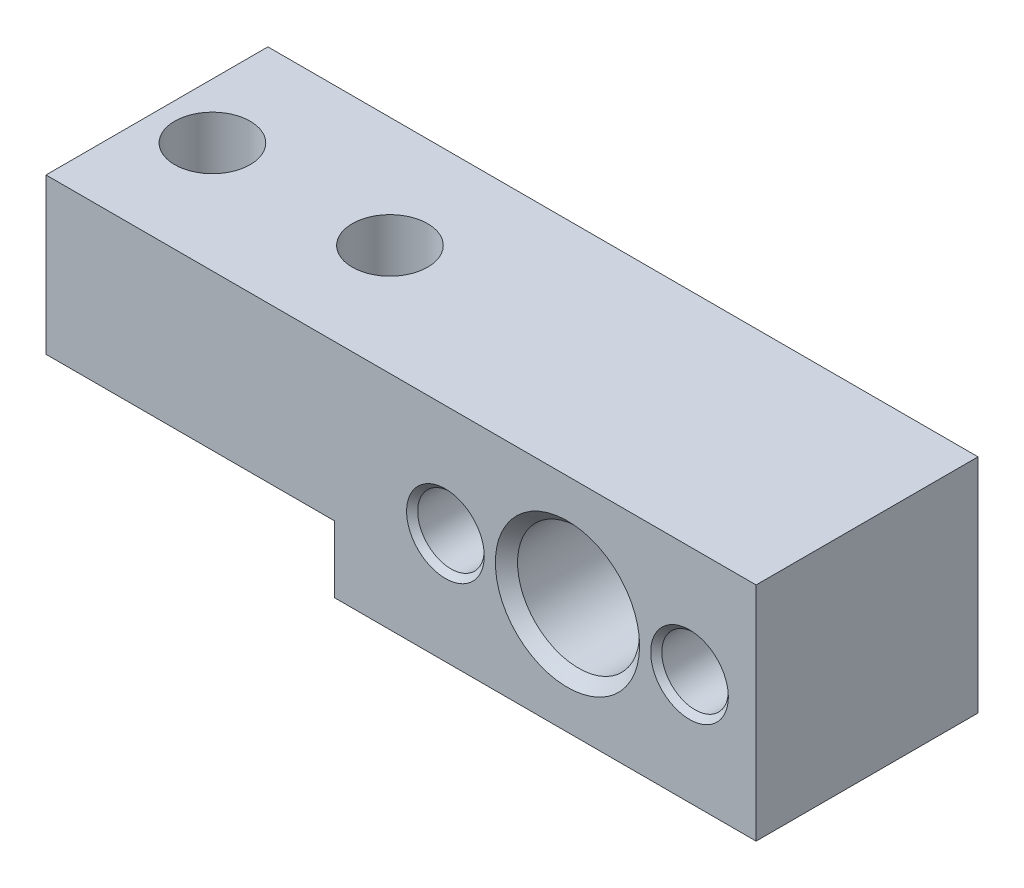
ISO-10303-21;
HEADER;
FILE_DESCRIPTION(('STEP AP214'),'2;1');
FILE_NAME('part.step','',(''),(''),'','','');
FILE_SCHEMA(('AUTOMOTIVE_DESIGN { 1 0 10303 214 1 1 1 1 }'));
ENDSEC;
DATA;
#1=APPLICATION_CONTEXT('core data for automotive mechanical design processes');
#2=APPLICATION_PROTOCOL_DEFINITION('international standard','automotive_design',2000,#1);
#3=PRODUCT_CONTEXT('',#1,'mechanical');
#4=PRODUCT('Part','Part','',(#3));
#5=PRODUCT_RELATED_PRODUCT_CATEGORY('part','',(#4));
#6=PRODUCT_DEFINITION_FORMATION('','',#4);
#7=PRODUCT_DEFINITION_CONTEXT('part definition',#1,'design');
#8=PRODUCT_DEFINITION('design','',#6,#7);
#9=PRODUCT_DEFINITION_SHAPE('','',#8);
#10=(LENGTH_UNIT() NAMED_UNIT(*) SI_UNIT(.MILLI.,.METRE.));
#11=(NAMED_UNIT(*) PLANE_ANGLE_UNIT() SI_UNIT($,.RADIAN.));
#12=(NAMED_UNIT(*) SI_UNIT($,.STERADIAN.) SOLID_ANGLE_UNIT());
#13=UNCERTAINTY_MEASURE_WITH_UNIT(LENGTH_MEASURE(1.E-05),#10,'distance_accuracy_value','');
#14=(GEOMETRIC_REPRESENTATION_CONTEXT(3) GLOBAL_UNCERTAINTY_ASSIGNED_CONTEXT((#13)) GLOBAL_UNIT_ASSIGNED_CONTEXT((#10,
#11,#12)) REPRESENTATION_CONTEXT('',''));
#15=CARTESIAN_POINT('',(0.,0.,0.));
#16=DIRECTION('',(0.,0.,1.));
#17=DIRECTION('',(1.,0.,0.));
#18=AXIS2_PLACEMENT_3D('',#15,#16,#17);
#19=CARTESIAN_POINT('',(-16.,-5.,9.99999999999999));
#20=DIRECTION('',(1.,0.,0.));
#21=DIRECTION('',(0.,0.,-1.));
#22=AXIS2_PLACEMENT_3D('',#19,#20,#21);
#23=PLANE('',#22);
#24=DIRECTION('',(0.,-1.,0.));
#25=VECTOR('',#24,1.);
#26=CARTESIAN_POINT('',(-16.,-5.,0.));
#27=LINE('',#26,#25);
#28=CARTESIAN_POINT('',(-16.,5.,0.));
#29=VERTEX_POINT('',#28);
#30=CARTESIAN_POINT('',(-16.,-2.,0.));
#31=VERTEX_POINT('',#30);
#32=EDGE_CURVE('E170',#29,#31,#27,.T.);
#33=ORIENTED_EDGE('',*,*,#32,.T.);
#34=DIRECTION('',(0.,0.,1.));
#35=VECTOR('',#34,1.);
#36=CARTESIAN_POINT('',(-16.,-2.,0.));
#37=LINE('',#36,#35);
#38=CARTESIAN_POINT('',(-16.,-2.,9.99999999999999));
#39=VERTEX_POINT('',#38);
#40=EDGE_CURVE('E167',#31,#39,#37,.T.);
#41=ORIENTED_EDGE('',*,*,#40,.T.);
#42=DIRECTION('',(0.,-1.,0.));
#43=VECTOR('',#42,1.);
#44=CARTESIAN_POINT('',(-16.,-5.,9.99999999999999));
#45=LINE('',#44,#43);
#46=CARTESIAN_POINT('',(-16.,5.,9.99999999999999));
#47=VERTEX_POINT('',#46);
#48=EDGE_CURVE('E106',#47,#39,#45,.T.);
#49=ORIENTED_EDGE('',*,*,#48,.F.);
#50=DIRECTION('',(0.,0.,-1.));
#51=VECTOR('',#50,1.);
#52=CARTESIAN_POINT('',(-16.,5.,9.99999999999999));
#53=LINE('',#52,#51);
#54=EDGE_CURVE('E114',#47,#29,#53,.T.);
#55=ORIENTED_EDGE('',*,*,#54,.T.);
#56=EDGE_LOOP('',(#33,#41,#49,#55));
#57=FACE_BOUND('',#56,.T.);
#58=ADVANCED_FACE('F28',(#57),#23,.F.);
#59=CARTESIAN_POINT('',(-16.,-5.,9.99999999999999));
#60=DIRECTION('',(0.,1.,0.));
#61=DIRECTION('',(0.,0.,1.));
#62=AXIS2_PLACEMENT_3D('',#59,#60,#61);
#63=PLANE('',#62);
#64=DIRECTION('',(1.,0.,0.));
#65=VECTOR('',#64,1.);
#66=CARTESIAN_POINT('',(-16.,-5.,9.99999999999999));
#67=LINE('',#66,#65);
#68=CARTESIAN_POINT('',(-2.99999999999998,-5.,10.));
#69=VERTEX_POINT('',#68);
#70=CARTESIAN_POINT('',(16.,-5.,10.));
#71=VERTEX_POINT('',#70);
#72=EDGE_CURVE('E96',#69,#71,#67,.T.);
#73=ORIENTED_EDGE('',*,*,#72,.F.);
#74=DIRECTION('',(0.,0.,1.));
#75=VECTOR('',#74,1.);
#76=CARTESIAN_POINT('',(-3.,-5.,0.));
#77=LINE('',#76,#75);
#78=CARTESIAN_POINT('',(-3.,-5.,0.));
#79=VERTEX_POINT('',#78);
#80=EDGE_CURVE('E83',#79,#69,#77,.T.);
#81=ORIENTED_EDGE('',*,*,#80,.F.);
#82=DIRECTION('',(1.,0.,0.));
#83=VECTOR('',#82,1.);
#84=CARTESIAN_POINT('',(-16.,-5.,0.));
#85=LINE('',#84,#83);
#86=CARTESIAN_POINT('',(16.,-5.,0.));
#87=VERTEX_POINT('',#86);
#88=EDGE_CURVE('E174',#79,#87,#85,.T.);
#89=ORIENTED_EDGE('',*,*,#88,.T.);
#90=DIRECTION('',(0.,0.,-1.));
#91=VECTOR('',#90,1.);
#92=CARTESIAN_POINT('',(16.,-5.,10.));
#93=LINE('',#92,#91);
#94=EDGE_CURVE('E103',#71,#87,#93,.T.);
#95=ORIENTED_EDGE('',*,*,#94,.F.);
#96=EDGE_LOOP('',(#73,#81,#89,#95));
#97=FACE_BOUND('',#96,.T.);
#98=ADVANCED_FACE('F101',(#97),#63,.F.);
#99=CARTESIAN_POINT('',(16.,-5.,10.));
#100=DIRECTION('',(-1.,0.,0.));
#101=DIRECTION('',(0.,0.,1.));
#102=AXIS2_PLACEMENT_3D('',#99,#100,#101);
#103=PLANE('',#102);
#104=DIRECTION('',(0.,1.,0.));
#105=VECTOR('',#104,1.);
#106=CARTESIAN_POINT('',(16.,-5.,0.));
#107=LINE('',#106,#105);
#108=CARTESIAN_POINT('',(16.,5.,0.));
#109=VERTEX_POINT('',#108);
#110=EDGE_CURVE('E176',#87,#109,#107,.T.);
#111=ORIENTED_EDGE('',*,*,#110,.T.);
#112=DIRECTION('',(0.,0.,-1.));
#113=VECTOR('',#112,1.);
#114=CARTESIAN_POINT('',(16.,5.,10.));
#115=LINE('',#114,#113);
#116=CARTESIAN_POINT('',(16.,5.,10.));
#117=VERTEX_POINT('',#116);
#118=EDGE_CURVE('E117',#117,#109,#115,.T.);
#119=ORIENTED_EDGE('',*,*,#118,.F.);
#120=DIRECTION('',(0.,1.,0.));
#121=VECTOR('',#120,1.);
#122=CARTESIAN_POINT('',(16.,-5.,10.));
#123=LINE('',#122,#121);
#124=EDGE_CURVE('E105',#71,#117,#123,.T.);
#125=ORIENTED_EDGE('',*,*,#124,.F.);
#126=ORIENTED_EDGE('',*,*,#94,.T.);
#127=EDGE_LOOP('',(#111,#119,#125,#126));
#128=FACE_BOUND('',#127,.T.);
#129=ADVANCED_FACE('F188',(#128),#103,.F.);
#130=CARTESIAN_POINT('',(-16.,5.,9.99999999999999));
#131=DIRECTION('',(0.,-1.,0.));
#132=DIRECTION('',(0.,0.,-1.));
#133=AXIS2_PLACEMENT_3D('',#130,#131,#132);
#134=PLANE('',#133);
#135=CARTESIAN_POINT('',(-13.5,5.,5.));
#136=DIRECTION('',(0.,1.,0.));
#137=DIRECTION('',(0.,0.,1.));
#138=AXIS2_PLACEMENT_3D('',#135,#136,#137);
#139=CIRCLE('',#138,1.69999999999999);
#140=CARTESIAN_POINT('',(-13.5,5.,6.7));
#141=VERTEX_POINT('',#140);
#142=EDGE_CURVE('E161',#141,#141,#139,.T.);
#143=ORIENTED_EDGE('',*,*,#142,.F.);
#144=EDGE_LOOP('',(#143));
#145=FACE_BOUND('',#144,.T.);
#146=CARTESIAN_POINT('',(-5.50000000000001,5.,5.));
#147=DIRECTION('',(0.,1.,0.));
#148=DIRECTION('',(0.,0.,1.));
#149=AXIS2_PLACEMENT_3D('',#146,#147,#148);
#150=CIRCLE('',#149,1.69999999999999);
#151=CARTESIAN_POINT('',(-5.50000000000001,5.,6.7));
#152=VERTEX_POINT('',#151);
#153=EDGE_CURVE('E153',#152,#152,#150,.T.);
#154=ORIENTED_EDGE('',*,*,#153,.F.);
#155=EDGE_LOOP('',(#154));
#156=FACE_BOUND('',#155,.T.);
#157=DIRECTION('',(-1.,0.,0.));
#158=VECTOR('',#157,1.);
#159=CARTESIAN_POINT('',(-16.,5.,0.));
#160=LINE('',#159,#158);
#161=EDGE_CURVE('E109',#109,#29,#160,.T.);
#162=ORIENTED_EDGE('',*,*,#161,.T.);
#163=ORIENTED_EDGE('',*,*,#54,.F.);
#164=DIRECTION('',(-1.,0.,0.));
#165=VECTOR('',#164,1.);
#166=CARTESIAN_POINT('',(-16.,5.,9.99999999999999));
#167=LINE('',#166,#165);
#168=EDGE_CURVE('E52',#117,#47,#167,.T.);
#169=ORIENTED_EDGE('',*,*,#168,.F.);
#170=ORIENTED_EDGE('',*,*,#118,.T.);
#171=EDGE_LOOP('',(#162,#163,#169,#170));
#172=FACE_BOUND('',#171,.T.);
#173=ADVANCED_FACE('F179',(#145,#156,#172),#134,.F.);
#174=CARTESIAN_POINT('',(-16.,5.,9.99999999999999));
#175=DIRECTION('',(0.,0.,-1.));
#176=DIRECTION('',(-1.,0.,0.));
#177=AXIS2_PLACEMENT_3D('',#174,#175,#176);
#178=PLANE('',#177);
#179=CARTESIAN_POINT('',(13.,0.,9.99999999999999));
#180=DIRECTION('',(0.,0.,-1.));
#181=DIRECTION('',(-1.,0.,0.));
#182=AXIS2_PLACEMENT_3D('',#179,#180,#181);
#183=CIRCLE('',#182,1.75);
#184=CARTESIAN_POINT('',(14.75,0.,10.));
#185=VERTEX_POINT('',#184);
#186=EDGE_CURVE('E148',#185,#185,#183,.T.);
#187=ORIENTED_EDGE('',*,*,#186,.T.);
#188=EDGE_LOOP('',(#187));
#189=FACE_BOUND('',#188,.T.);
#190=CARTESIAN_POINT('',(1.99999999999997,0.,9.99999999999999));
#191=DIRECTION('',(0.,0.,-1.));
#192=DIRECTION('',(-1.,0.,0.));
#193=AXIS2_PLACEMENT_3D('',#190,#191,#192);
#194=CIRCLE('',#193,1.75);
#195=CARTESIAN_POINT('',(3.74999999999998,0.,10.));
#196=VERTEX_POINT('',#195);
#197=EDGE_CURVE('E145',#196,#196,#194,.T.);
#198=ORIENTED_EDGE('',*,*,#197,.T.);
#199=EDGE_LOOP('',(#198));
#200=FACE_BOUND('',#199,.T.);
#201=CARTESIAN_POINT('',(7.49999999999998,0.,9.99999999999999));
#202=DIRECTION('',(0.,0.,-1.));
#203=DIRECTION('',(-1.,0.,0.));
#204=AXIS2_PLACEMENT_3D('',#201,#202,#203);
#205=CIRCLE('',#204,3.25);
#206=CARTESIAN_POINT('',(10.75,0.,10.));
#207=VERTEX_POINT('',#206);
#208=EDGE_CURVE('E130',#207,#207,#205,.T.);
#209=ORIENTED_EDGE('',*,*,#208,.T.);
#210=EDGE_LOOP('',(#209));
#211=FACE_BOUND('',#210,.T.);
#212=ORIENTED_EDGE('',*,*,#48,.T.);
#213=DIRECTION('',(-1.,0.,0.));
#214=VECTOR('',#213,1.);
#215=CARTESIAN_POINT('',(-16.,-2.,9.99999999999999));
#216=LINE('',#215,#214);
#217=CARTESIAN_POINT('',(-3.,-2.00000000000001,10.));
#218=VERTEX_POINT('',#217);
#219=EDGE_CURVE('E98',#218,#39,#216,.T.);
#220=ORIENTED_EDGE('',*,*,#219,.F.);
#221=DIRECTION('',(0.,1.,0.));
#222=VECTOR('',#221,1.);
#223=CARTESIAN_POINT('',(-2.99999999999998,-5.,10.));
#224=LINE('',#223,#222);
#225=EDGE_CURVE('E86',#69,#218,#224,.T.);
#226=ORIENTED_EDGE('',*,*,#225,.F.);
#227=ORIENTED_EDGE('',*,*,#72,.T.);
#228=ORIENTED_EDGE('',*,*,#124,.T.);
#229=ORIENTED_EDGE('',*,*,#168,.T.);
#230=EDGE_LOOP('',(#212,#220,#226,#227,#228,#229));
#231=FACE_BOUND('',#230,.T.);
#232=ADVANCED_FACE('F95',(#189,#200,#211,#231),#178,.F.);
#233=CARTESIAN_POINT('',(-16.,5.,0.));
#234=DIRECTION('',(0.,0.,-1.));
#235=DIRECTION('',(-1.,0.,0.));
#236=AXIS2_PLACEMENT_3D('',#233,#234,#235);
#237=PLANE('',#236);
#238=CARTESIAN_POINT('',(13.,0.,0.));
#239=DIRECTION('',(0.,0.,-1.));
#240=DIRECTION('',(-1.,0.,0.));
#241=AXIS2_PLACEMENT_3D('',#238,#239,#240);
#242=CIRCLE('',#241,1.75);
#243=CARTESIAN_POINT('',(11.25,0.,0.));
#244=VERTEX_POINT('',#243);
#245=EDGE_CURVE('E136',#244,#244,#242,.F.);
#246=ORIENTED_EDGE('',*,*,#245,.T.);
#247=EDGE_LOOP('',(#246));
#248=FACE_BOUND('',#247,.T.);
#249=CARTESIAN_POINT('',(1.99999999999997,0.,0.));
#250=DIRECTION('',(0.,0.,-1.));
#251=DIRECTION('',(-1.,0.,0.));
#252=AXIS2_PLACEMENT_3D('',#249,#250,#251);
#253=CIRCLE('',#252,1.75);
#254=CARTESIAN_POINT('',(0.249999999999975,0.,0.));
#255=VERTEX_POINT('',#254);
#256=EDGE_CURVE('E133',#255,#255,#253,.F.);
#257=ORIENTED_EDGE('',*,*,#256,.T.);
#258=EDGE_LOOP('',(#257));
#259=FACE_BOUND('',#258,.T.);
#260=CARTESIAN_POINT('',(7.49999999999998,0.,0.));
#261=DIRECTION('',(0.,0.,-1.));
#262=DIRECTION('',(-1.,0.,0.));
#263=AXIS2_PLACEMENT_3D('',#260,#261,#262);
#264=CIRCLE('',#263,3.25);
#265=CARTESIAN_POINT('',(4.24999999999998,0.,0.));
#266=VERTEX_POINT('',#265);
#267=EDGE_CURVE('E121',#266,#266,#264,.F.);
#268=ORIENTED_EDGE('',*,*,#267,.T.);
#269=EDGE_LOOP('',(#268));
#270=FACE_BOUND('',#269,.T.);
#271=DIRECTION('',(-1.,0.,0.));
#272=VECTOR('',#271,1.);
#273=CARTESIAN_POINT('',(-16.,-2.,0.));
#274=LINE('',#273,#272);
#275=CARTESIAN_POINT('',(-3.,-2.,0.));
#276=VERTEX_POINT('',#275);
#277=EDGE_CURVE('E44',#276,#31,#274,.T.);
#278=ORIENTED_EDGE('',*,*,#277,.T.);
#279=ORIENTED_EDGE('',*,*,#32,.F.);
#280=ORIENTED_EDGE('',*,*,#161,.F.);
#281=ORIENTED_EDGE('',*,*,#110,.F.);
#282=ORIENTED_EDGE('',*,*,#88,.F.);
#283=DIRECTION('',(0.,1.,0.));
#284=VECTOR('',#283,1.);
#285=CARTESIAN_POINT('',(-3.,-5.,0.));
#286=LINE('',#285,#284);
#287=EDGE_CURVE('E89',#79,#276,#286,.T.);
#288=ORIENTED_EDGE('',*,*,#287,.T.);
#289=EDGE_LOOP('',(#278,#279,#280,#281,#282,#288));
#290=FACE_BOUND('',#289,.T.);
#291=ADVANCED_FACE('F186',(#248,#259,#270,#290),#237,.T.);
#292=CARTESIAN_POINT('',(-16.,-2.,0.));
#293=DIRECTION('',(0.,1.,0.));
#294=DIRECTION('',(0.,0.,1.));
#295=AXIS2_PLACEMENT_3D('',#292,#293,#294);
#296=PLANE('',#295);
#297=CARTESIAN_POINT('',(-13.5,-2.,5.));
#298=DIRECTION('',(0.,1.,0.));
#299=DIRECTION('',(0.,0.,1.));
#300=AXIS2_PLACEMENT_3D('',#297,#298,#299);
#301=CIRCLE('',#300,1.69999999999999);
#302=CARTESIAN_POINT('',(-13.5,-2.,6.7));
#303=VERTEX_POINT('',#302);
#304=EDGE_CURVE('E31',#303,#303,#301,.T.);
#305=ORIENTED_EDGE('',*,*,#304,.T.);
#306=EDGE_LOOP('',(#305));
#307=FACE_BOUND('',#306,.T.);
#308=CARTESIAN_POINT('',(-5.49999999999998,-2.,5.));
#309=DIRECTION('',(0.,1.,0.));
#310=DIRECTION('',(0.,0.,1.));
#311=AXIS2_PLACEMENT_3D('',#308,#309,#310);
#312=CIRCLE('',#311,1.69999999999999);
#313=CARTESIAN_POINT('',(-5.50000000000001,-2.,6.7));
#314=VERTEX_POINT('',#313);
#315=EDGE_CURVE('E99',#314,#314,#312,.T.);
#316=ORIENTED_EDGE('',*,*,#315,.T.);
#317=EDGE_LOOP('',(#316));
#318=FACE_BOUND('',#317,.T.);
#319=ORIENTED_EDGE('',*,*,#219,.T.);
#320=ORIENTED_EDGE('',*,*,#40,.F.);
#321=ORIENTED_EDGE('',*,*,#277,.F.);
#322=DIRECTION('',(0.,0.,1.));
#323=VECTOR('',#322,1.);
#324=CARTESIAN_POINT('',(-3.,-2.,0.));
#325=LINE('',#324,#323);
#326=EDGE_CURVE('E93',#276,#218,#325,.T.);
#327=ORIENTED_EDGE('',*,*,#326,.T.);
#328=EDGE_LOOP('',(#319,#320,#321,#327));
#329=FACE_BOUND('',#328,.T.);
#330=ADVANCED_FACE('F232',(#307,#318,#329),#296,.F.);
#331=CARTESIAN_POINT('',(-3.,-5.,0.));
#332=DIRECTION('',(1.,0.,0.));
#333=DIRECTION('',(0.,0.,-1.));
#334=AXIS2_PLACEMENT_3D('',#331,#332,#333);
#335=PLANE('',#334);
#336=ORIENTED_EDGE('',*,*,#225,.T.);
#337=ORIENTED_EDGE('',*,*,#326,.F.);
#338=ORIENTED_EDGE('',*,*,#287,.F.);
#339=ORIENTED_EDGE('',*,*,#80,.T.);
#340=EDGE_LOOP('',(#336,#337,#338,#339));
#341=FACE_BOUND('',#340,.T.);
#342=ADVANCED_FACE('F85',(#341),#335,.F.);
#343=CARTESIAN_POINT('',(7.49999999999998,0.,0.));
#344=DIRECTION('',(0.,0.,1.));
#345=DIRECTION('',(1.,0.,0.));
#346=AXIS2_PLACEMENT_3D('',#343,#344,#345);
#347=CYLINDRICAL_SURFACE('',#346,2.75);
#348=CARTESIAN_POINT('',(7.49999999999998,0.,0.500000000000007));
#349=DIRECTION('',(0.,0.,-1.));
#350=DIRECTION('',(-1.,0.,0.));
#351=AXIS2_PLACEMENT_3D('',#348,#349,#350);
#352=CIRCLE('',#351,2.75);
#353=CARTESIAN_POINT('',(10.25,0.,0.500000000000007));
#354=VERTEX_POINT('',#353);
#355=EDGE_CURVE('E127',#354,#354,#352,.T.);
#356=CARTESIAN_POINT('',(7.49999999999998,0.,9.49999999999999));
#357=DIRECTION('',(0.,0.,-1.));
#358=DIRECTION('',(-1.,0.,0.));
#359=AXIS2_PLACEMENT_3D('',#356,#357,#358);
#360=CIRCLE('',#359,2.75);
#361=CARTESIAN_POINT('',(10.25,0.,9.5));
#362=VERTEX_POINT('',#361);
#363=EDGE_CURVE('E124',#362,#362,#360,.F.);
#364=CARTESIAN_POINT('',(10.25,0.,0.500000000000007));
#365=CARTESIAN_POINT('',(10.25,0.,0.593750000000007));
#366=CARTESIAN_POINT('',(10.25,0.,0.687500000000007));
#367=CARTESIAN_POINT('',(10.25,0.,0.875000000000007));
#368=CARTESIAN_POINT('',(10.25,0.,0.968750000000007));
#369=CARTESIAN_POINT('',(10.25,0.,1.15625000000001));
#370=CARTESIAN_POINT('',(10.25,0.,1.25000000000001));
#371=CARTESIAN_POINT('',(10.25,0.,1.43750000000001));
#372=CARTESIAN_POINT('',(10.25,0.,1.53125000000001));
#373=CARTESIAN_POINT('',(10.25,0.,1.71875000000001));
#374=CARTESIAN_POINT('',(10.25,0.,1.81250000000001));
#375=CARTESIAN_POINT('',(10.25,0.,2.00000000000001));
#376=CARTESIAN_POINT('',(10.25,0.,2.09375000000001));
#377=CARTESIAN_POINT('',(10.25,0.,2.28125000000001));
#378=CARTESIAN_POINT('',(10.25,0.,2.37500000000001));
#379=CARTESIAN_POINT('',(10.25,0.,2.5625));
#380=CARTESIAN_POINT('',(10.25,0.,2.65625));
#381=CARTESIAN_POINT('',(10.25,0.,2.84375));
#382=CARTESIAN_POINT('',(10.25,0.,2.9375));
#383=CARTESIAN_POINT('',(10.25,0.,3.125));
#384=CARTESIAN_POINT('',(10.25,0.,3.21875));
#385=CARTESIAN_POINT('',(10.25,0.,3.40625));
#386=CARTESIAN_POINT('',(10.25,0.,3.5));
#387=CARTESIAN_POINT('',(10.25,0.,3.6875));
#388=CARTESIAN_POINT('',(10.25,0.,3.78125));
#389=CARTESIAN_POINT('',(10.25,0.,3.96875));
#390=CARTESIAN_POINT('',(10.25,0.,4.0625));
#391=CARTESIAN_POINT('',(10.25,0.,4.25));
#392=CARTESIAN_POINT('',(10.25,0.,4.34375));
#393=CARTESIAN_POINT('',(10.25,0.,4.53125));
#394=CARTESIAN_POINT('',(10.25,0.,4.625));
#395=CARTESIAN_POINT('',(10.25,0.,4.8125));
#396=CARTESIAN_POINT('',(10.25,0.,4.90625));
#397=CARTESIAN_POINT('',(10.25,0.,5.09375));
#398=CARTESIAN_POINT('',(10.25,0.,5.1875));
#399=CARTESIAN_POINT('',(10.25,0.,5.375));
#400=CARTESIAN_POINT('',(10.25,0.,5.46875));
#401=CARTESIAN_POINT('',(10.25,0.,5.65625));
#402=CARTESIAN_POINT('',(10.25,0.,5.75));
#403=CARTESIAN_POINT('',(10.25,0.,5.9375));
#404=CARTESIAN_POINT('',(10.25,0.,6.03125));
#405=CARTESIAN_POINT('',(10.25,0.,6.21875));
#406=CARTESIAN_POINT('',(10.25,0.,6.3125));
#407=CARTESIAN_POINT('',(10.25,0.,6.5));
#408=CARTESIAN_POINT('',(10.25,0.,6.59375));
#409=CARTESIAN_POINT('',(10.25,0.,6.78125));
#410=CARTESIAN_POINT('',(10.25,0.,6.875));
#411=CARTESIAN_POINT('',(10.25,0.,7.0625));
#412=CARTESIAN_POINT('',(10.25,0.,7.15625));
#413=CARTESIAN_POINT('',(10.25,0.,7.34375));
#414=CARTESIAN_POINT('',(10.25,0.,7.4375));
#415=CARTESIAN_POINT('',(10.25,0.,7.625));
#416=CARTESIAN_POINT('',(10.25,0.,7.71875));
#417=CARTESIAN_POINT('',(10.25,0.,7.90625));
#418=CARTESIAN_POINT('',(10.25,0.,8.));
#419=CARTESIAN_POINT('',(10.25,0.,8.1875));
#420=CARTESIAN_POINT('',(10.25,0.,8.28125));
#421=CARTESIAN_POINT('',(10.25,0.,8.46875));
#422=CARTESIAN_POINT('',(10.25,0.,8.5625));
#423=CARTESIAN_POINT('',(10.25,0.,8.75));
#424=CARTESIAN_POINT('',(10.25,0.,8.84375));
#425=CARTESIAN_POINT('',(10.25,0.,9.03125));
#426=CARTESIAN_POINT('',(10.25,0.,9.125));
#427=CARTESIAN_POINT('',(10.25,0.,9.3125));
#428=CARTESIAN_POINT('',(10.25,0.,9.40625));
#429=CARTESIAN_POINT('',(10.25,0.,9.5));
#430=B_SPLINE_CURVE_WITH_KNOTS('',3,(#364,#365,#366,#367,#368,#369,#370,#371,#372,#373,#374,
#375,#376,#377,#378,#379,#380,#381,#382,#383,#384,#385,#386,#387,#388,#389,#390,#391,#392,#393,
#394,#395,#396,#397,#398,#399,#400,#401,#402,#403,#404,#405,#406,#407,#408,#409,#410,#411,#412,
#413,#414,#415,#416,#417,#418,#419,#420,#421,#422,#423,#424,#425,#426,#427,#428,#429),
.UNSPECIFIED.,.F.,.F.,(4,2,2,2,2,2,2,2,2,2,2,2,2,2,2,2,2,2,2,2,2,2,2,2,2,2,2,2,2,2,2,2,4),(0.,
0.28125,0.562499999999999,0.843749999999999,1.125,1.40625,1.6875,1.96875,2.25,2.53125,2.8125,
3.09375,3.375,3.65625,3.93749999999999,4.21874999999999,4.49999999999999,4.78124999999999,
5.06249999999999,5.34374999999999,5.62499999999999,5.90624999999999,6.18749999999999,
6.46874999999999,6.74999999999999,7.03124999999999,7.31249999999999,7.59374999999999,
7.87499999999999,8.15624999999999,8.43749999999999,8.71874999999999,8.99999999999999),.UNSPECIFIED.);
#431=EDGE_CURVE('BSEAM251',#354,#362,#430,.T.);
#432=ORIENTED_EDGE('',*,*,#355,.T.);
#433=ORIENTED_EDGE('',*,*,#363,.T.);
#434=ORIENTED_EDGE('',*,*,#431,.T.);
#435=ORIENTED_EDGE('',*,*,#431,.F.);
#436=EDGE_LOOP('',(#432,#434,#433,#435));
#437=FACE_BOUND('',#436,.T.);
#438=ADVANCED_FACE('F251',(#437),#347,.F.);
#439=CARTESIAN_POINT('',(13.,0.,0.));
#440=DIRECTION('',(0.,0.,1.));
#441=DIRECTION('',(1.,0.,0.));
#442=AXIS2_PLACEMENT_3D('',#439,#440,#441);
#443=CYLINDRICAL_SURFACE('',#442,1.5);
#444=CARTESIAN_POINT('',(13.,0.,0.250000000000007));
#445=DIRECTION('',(0.,0.,-1.));
#446=DIRECTION('',(-1.,0.,0.));
#447=AXIS2_PLACEMENT_3D('',#444,#445,#446);
#448=CIRCLE('',#447,1.5);
#449=CARTESIAN_POINT('',(14.5,0.,0.250000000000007));
#450=VERTEX_POINT('',#449);
#451=EDGE_CURVE('E142',#450,#450,#448,.T.);
#452=CARTESIAN_POINT('',(13.,0.,9.74999999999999));
#453=DIRECTION('',(0.,0.,-1.));
#454=DIRECTION('',(-1.,0.,0.));
#455=AXIS2_PLACEMENT_3D('',#452,#453,#454);
#456=CIRCLE('',#455,1.5);
#457=CARTESIAN_POINT('',(14.5,0.,9.75));
#458=VERTEX_POINT('',#457);
#459=EDGE_CURVE('E139',#458,#458,#456,.F.);
#460=CARTESIAN_POINT('',(14.5,0.,0.250000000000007));
#461=CARTESIAN_POINT('',(14.5,0.,0.34895833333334));
#462=CARTESIAN_POINT('',(14.5,0.,0.447916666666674));
#463=CARTESIAN_POINT('',(14.5,0.,0.64583333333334));
#464=CARTESIAN_POINT('',(14.5,0.,0.744791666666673));
#465=CARTESIAN_POINT('',(14.5,0.,0.94270833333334));
#466=CARTESIAN_POINT('',(14.5,0.,1.04166666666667));
#467=CARTESIAN_POINT('',(14.5,0.,1.23958333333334));
#468=CARTESIAN_POINT('',(14.5,0.,1.33854166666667));
#469=CARTESIAN_POINT('',(14.5,0.,1.53645833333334));
#470=CARTESIAN_POINT('',(14.5,0.,1.63541666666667));
#471=CARTESIAN_POINT('',(14.5,0.,1.83333333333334));
#472=CARTESIAN_POINT('',(14.5,0.,1.93229166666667));
#473=CARTESIAN_POINT('',(14.5,0.,2.13020833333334));
#474=CARTESIAN_POINT('',(14.5,0.,2.22916666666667));
#475=CARTESIAN_POINT('',(14.5,0.,2.42708333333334));
#476=CARTESIAN_POINT('',(14.5,0.,2.52604166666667));
#477=CARTESIAN_POINT('',(14.5,0.,2.72395833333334));
#478=CARTESIAN_POINT('',(14.5,0.,2.82291666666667));
#479=CARTESIAN_POINT('',(14.5,0.,3.02083333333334));
#480=CARTESIAN_POINT('',(14.5,0.,3.11979166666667));
#481=CARTESIAN_POINT('',(14.5,0.,3.31770833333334));
#482=CARTESIAN_POINT('',(14.5,0.,3.41666666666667));
#483=CARTESIAN_POINT('',(14.5,0.,3.61458333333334));
#484=CARTESIAN_POINT('',(14.5,0.,3.71354166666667));
#485=CARTESIAN_POINT('',(14.5,0.,3.91145833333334));
#486=CARTESIAN_POINT('',(14.5,0.,4.01041666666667));
#487=CARTESIAN_POINT('',(14.5,0.,4.20833333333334));
#488=CARTESIAN_POINT('',(14.5,0.,4.30729166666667));
#489=CARTESIAN_POINT('',(14.5,0.,4.50520833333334));
#490=CARTESIAN_POINT('',(14.5,0.,4.60416666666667));
#491=CARTESIAN_POINT('',(14.5,0.,4.80208333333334));
#492=CARTESIAN_POINT('',(14.5,0.,4.90104166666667));
#493=CARTESIAN_POINT('',(14.5,0.,5.09895833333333));
#494=CARTESIAN_POINT('',(14.5,0.,5.19791666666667));
#495=CARTESIAN_POINT('',(14.5,0.,5.39583333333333));
#496=CARTESIAN_POINT('',(14.5,0.,5.49479166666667));
#497=CARTESIAN_POINT('',(14.5,0.,5.69270833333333));
#498=CARTESIAN_POINT('',(14.5,0.,5.79166666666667));
#499=CARTESIAN_POINT('',(14.5,0.,5.98958333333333));
#500=CARTESIAN_POINT('',(14.5,0.,6.08854166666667));
#501=CARTESIAN_POINT('',(14.5,0.,6.28645833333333));
#502=CARTESIAN_POINT('',(14.5,0.,6.38541666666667));
#503=CARTESIAN_POINT('',(14.5,0.,6.58333333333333));
#504=CARTESIAN_POINT('',(14.5,0.,6.68229166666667));
#505=CARTESIAN_POINT('',(14.5,0.,6.88020833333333));
#506=CARTESIAN_POINT('',(14.5,0.,6.97916666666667));
#507=CARTESIAN_POINT('',(14.5,0.,7.17708333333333));
#508=CARTESIAN_POINT('',(14.5,0.,7.27604166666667));
#509=CARTESIAN_POINT('',(14.5,0.,7.47395833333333));
#510=CARTESIAN_POINT('',(14.5,0.,7.57291666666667));
#511=CARTESIAN_POINT('',(14.5,0.,7.77083333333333));
#512=CARTESIAN_POINT('',(14.5,0.,7.86979166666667));
#513=CARTESIAN_POINT('',(14.5,0.,8.06770833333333));
#514=CARTESIAN_POINT('',(14.5,0.,8.16666666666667));
#515=CARTESIAN_POINT('',(14.5,0.,8.36458333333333));
#516=CARTESIAN_POINT('',(14.5,0.,8.46354166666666));
#517=CARTESIAN_POINT('',(14.5,0.,8.66145833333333));
#518=CARTESIAN_POINT('',(14.5,0.,8.76041666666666));
#519=CARTESIAN_POINT('',(14.5,0.,8.95833333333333));
#520=CARTESIAN_POINT('',(14.5,0.,9.05729166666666));
#521=CARTESIAN_POINT('',(14.5,0.,9.25520833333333));
#522=CARTESIAN_POINT('',(14.5,0.,9.35416666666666));
#523=CARTESIAN_POINT('',(14.5,0.,9.55208333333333));
#524=CARTESIAN_POINT('',(14.5,0.,9.65104166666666));
#525=CARTESIAN_POINT('',(14.5,0.,9.75));
#526=B_SPLINE_CURVE_WITH_KNOTS('',3,(#460,#461,#462,#463,#464,#465,#466,#467,#468,#469,#470,
#471,#472,#473,#474,#475,#476,#477,#478,#479,#480,#481,#482,#483,#484,#485,#486,#487,#488,#489,
#490,#491,#492,#493,#494,#495,#496,#497,#498,#499,#500,#501,#502,#503,#504,#505,#506,#507,#508,
#509,#510,#511,#512,#513,#514,#515,#516,#517,#518,#519,#520,#521,#522,#523,#524,#525),
.UNSPECIFIED.,.F.,.F.,(4,2,2,2,2,2,2,2,2,2,2,2,2,2,2,2,2,2,2,2,2,2,2,2,2,2,2,2,2,2,2,2,4),(0.,
0.296875,0.593749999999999,0.890624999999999,1.1875,1.484375,1.78125,2.078125,2.375,2.671875,
2.96875,3.265625,3.5625,3.859375,4.15624999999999,4.453125,4.74999999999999,5.04687499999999,
5.34374999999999,5.64062499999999,5.93749999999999,6.23437499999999,6.53124999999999,
6.82812499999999,7.12499999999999,7.42187499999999,7.71874999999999,8.01562499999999,
8.31249999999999,8.60937499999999,8.90624999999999,9.20312499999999,9.49999999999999),.UNSPECIFIED.);
#527=EDGE_CURVE('BSEAM260',#450,#458,#526,.T.);
#528=ORIENTED_EDGE('',*,*,#451,.T.);
#529=ORIENTED_EDGE('',*,*,#459,.T.);
#530=ORIENTED_EDGE('',*,*,#527,.T.);
#531=ORIENTED_EDGE('',*,*,#527,.F.);
#532=EDGE_LOOP('',(#528,#530,#529,#531));
#533=FACE_BOUND('',#532,.T.);
#534=ADVANCED_FACE('F260',(#533),#443,.F.);
#535=CARTESIAN_POINT('',(1.99999999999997,0.,0.));
#536=DIRECTION('',(0.,0.,1.));
#537=DIRECTION('',(1.,0.,0.));
#538=AXIS2_PLACEMENT_3D('',#535,#536,#537);
#539=CYLINDRICAL_SURFACE('',#538,1.5);
#540=CARTESIAN_POINT('',(1.99999999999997,0.,0.250000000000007));
#541=DIRECTION('',(0.,0.,-1.));
#542=DIRECTION('',(-1.,0.,0.));
#543=AXIS2_PLACEMENT_3D('',#540,#541,#542);
#544=CIRCLE('',#543,1.5);
#545=CARTESIAN_POINT('',(3.49999999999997,0.,0.250000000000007));
#546=VERTEX_POINT('',#545);
#547=EDGE_CURVE('E11',#546,#546,#544,.T.);
#548=CARTESIAN_POINT('',(1.99999999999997,0.,9.74999999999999));
#549=DIRECTION('',(0.,0.,-1.));
#550=DIRECTION('',(-1.,0.,0.));
#551=AXIS2_PLACEMENT_3D('',#548,#549,#550);
#552=CIRCLE('',#551,1.5);
#553=CARTESIAN_POINT('',(3.49999999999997,0.,9.75));
#554=VERTEX_POINT('',#553);
#555=EDGE_CURVE('E36',#554,#554,#552,.F.);
#556=CARTESIAN_POINT('',(3.49999999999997,0.,0.250000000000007));
#557=CARTESIAN_POINT('',(3.49999999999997,0.,0.34895833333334));
#558=CARTESIAN_POINT('',(3.49999999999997,0.,0.447916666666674));
#559=CARTESIAN_POINT('',(3.49999999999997,0.,0.64583333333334));
#560=CARTESIAN_POINT('',(3.49999999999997,0.,0.744791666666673));
#561=CARTESIAN_POINT('',(3.49999999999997,0.,0.94270833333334));
#562=CARTESIAN_POINT('',(3.49999999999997,0.,1.04166666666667));
#563=CARTESIAN_POINT('',(3.49999999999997,0.,1.23958333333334));
#564=CARTESIAN_POINT('',(3.49999999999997,0.,1.33854166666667));
#565=CARTESIAN_POINT('',(3.49999999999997,0.,1.53645833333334));
#566=CARTESIAN_POINT('',(3.49999999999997,0.,1.63541666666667));
#567=CARTESIAN_POINT('',(3.49999999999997,0.,1.83333333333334));
#568=CARTESIAN_POINT('',(3.49999999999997,0.,1.93229166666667));
#569=CARTESIAN_POINT('',(3.49999999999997,0.,2.13020833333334));
#570=CARTESIAN_POINT('',(3.49999999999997,0.,2.22916666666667));
#571=CARTESIAN_POINT('',(3.49999999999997,0.,2.42708333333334));
#572=CARTESIAN_POINT('',(3.49999999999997,0.,2.52604166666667));
#573=CARTESIAN_POINT('',(3.49999999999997,0.,2.72395833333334));
#574=CARTESIAN_POINT('',(3.49999999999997,0.,2.82291666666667));
#575=CARTESIAN_POINT('',(3.49999999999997,0.,3.02083333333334));
#576=CARTESIAN_POINT('',(3.49999999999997,0.,3.11979166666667));
#577=CARTESIAN_POINT('',(3.49999999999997,0.,3.31770833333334));
#578=CARTESIAN_POINT('',(3.49999999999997,0.,3.41666666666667));
#579=CARTESIAN_POINT('',(3.49999999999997,0.,3.61458333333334));
#580=CARTESIAN_POINT('',(3.49999999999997,0.,3.71354166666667));
#581=CARTESIAN_POINT('',(3.49999999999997,0.,3.91145833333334));
#582=CARTESIAN_POINT('',(3.49999999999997,0.,4.01041666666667));
#583=CARTESIAN_POINT('',(3.49999999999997,0.,4.20833333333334));
#584=CARTESIAN_POINT('',(3.49999999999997,0.,4.30729166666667));
#585=CARTESIAN_POINT('',(3.49999999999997,0.,4.50520833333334));
#586=CARTESIAN_POINT('',(3.49999999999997,0.,4.60416666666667));
#587=CARTESIAN_POINT('',(3.49999999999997,0.,4.80208333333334));
#588=CARTESIAN_POINT('',(3.49999999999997,0.,4.90104166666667));
#589=CARTESIAN_POINT('',(3.49999999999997,0.,5.09895833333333));
#590=CARTESIAN_POINT('',(3.49999999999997,0.,5.19791666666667));
#591=CARTESIAN_POINT('',(3.49999999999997,0.,5.39583333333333));
#592=CARTESIAN_POINT('',(3.49999999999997,0.,5.49479166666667));
#593=CARTESIAN_POINT('',(3.49999999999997,0.,5.69270833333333));
#594=CARTESIAN_POINT('',(3.49999999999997,0.,5.79166666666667));
#595=CARTESIAN_POINT('',(3.49999999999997,0.,5.98958333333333));
#596=CARTESIAN_POINT('',(3.49999999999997,0.,6.08854166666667));
#597=CARTESIAN_POINT('',(3.49999999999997,0.,6.28645833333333));
#598=CARTESIAN_POINT('',(3.49999999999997,0.,6.38541666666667));
#599=CARTESIAN_POINT('',(3.49999999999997,0.,6.58333333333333));
#600=CARTESIAN_POINT('',(3.49999999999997,0.,6.68229166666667));
#601=CARTESIAN_POINT('',(3.49999999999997,0.,6.88020833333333));
#602=CARTESIAN_POINT('',(3.49999999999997,0.,6.97916666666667));
#603=CARTESIAN_POINT('',(3.49999999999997,0.,7.17708333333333));
#604=CARTESIAN_POINT('',(3.49999999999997,0.,7.27604166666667));
#605=CARTESIAN_POINT('',(3.49999999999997,0.,7.47395833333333));
#606=CARTESIAN_POINT('',(3.49999999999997,0.,7.57291666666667));
#607=CARTESIAN_POINT('',(3.49999999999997,0.,7.77083333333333));
#608=CARTESIAN_POINT('',(3.49999999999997,0.,7.86979166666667));
#609=CARTESIAN_POINT('',(3.49999999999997,0.,8.06770833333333));
#610=CARTESIAN_POINT('',(3.49999999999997,0.,8.16666666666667));
#611=CARTESIAN_POINT('',(3.49999999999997,0.,8.36458333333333));
#612=CARTESIAN_POINT('',(3.49999999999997,0.,8.46354166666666));
#613=CARTESIAN_POINT('',(3.49999999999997,0.,8.66145833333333));
#614=CARTESIAN_POINT('',(3.49999999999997,0.,8.76041666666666));
#615=CARTESIAN_POINT('',(3.49999999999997,0.,8.95833333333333));
#616=CARTESIAN_POINT('',(3.49999999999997,0.,9.05729166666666));
#617=CARTESIAN_POINT('',(3.49999999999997,0.,9.25520833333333));
#618=CARTESIAN_POINT('',(3.49999999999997,0.,9.35416666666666));
#619=CARTESIAN_POINT('',(3.49999999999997,0.,9.55208333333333));
#620=CARTESIAN_POINT('',(3.49999999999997,0.,9.65104166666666));
#621=CARTESIAN_POINT('',(3.49999999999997,0.,9.75));
#622=B_SPLINE_CURVE_WITH_KNOTS('',3,(#556,#557,#558,#559,#560,#561,#562,#563,#564,#565,#566,
#567,#568,#569,#570,#571,#572,#573,#574,#575,#576,#577,#578,#579,#580,#581,#582,#583,#584,#585,
#586,#587,#588,#589,#590,#591,#592,#593,#594,#595,#596,#597,#598,#599,#600,#601,#602,#603,#604,
#605,#606,#607,#608,#609,#610,#611,#612,#613,#614,#615,#616,#617,#618,#619,#620,#621),
.UNSPECIFIED.,.F.,.F.,(4,2,2,2,2,2,2,2,2,2,2,2,2,2,2,2,2,2,2,2,2,2,2,2,2,2,2,2,2,2,2,2,4),(0.,
0.296875,0.593749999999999,0.890624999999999,1.1875,1.484375,1.78125,2.078125,2.375,2.671875,
2.96875,3.265625,3.5625,3.859375,4.15624999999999,4.453125,4.74999999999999,5.04687499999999,
5.34374999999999,5.64062499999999,5.93749999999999,6.23437499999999,6.53124999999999,
6.82812499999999,7.12499999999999,7.42187499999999,7.71874999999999,8.01562499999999,
8.31249999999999,8.60937499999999,8.90624999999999,9.20312499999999,9.49999999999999),.UNSPECIFIED.);
#623=EDGE_CURVE('BSEAM270',#546,#554,#622,.T.);
#624=ORIENTED_EDGE('',*,*,#547,.T.);
#625=ORIENTED_EDGE('',*,*,#555,.T.);
#626=ORIENTED_EDGE('',*,*,#623,.T.);
#627=ORIENTED_EDGE('',*,*,#623,.F.);
#628=EDGE_LOOP('',(#624,#626,#625,#627));
#629=FACE_BOUND('',#628,.T.);
#630=ADVANCED_FACE('F270',(#629),#539,.F.);
#631=CARTESIAN_POINT('',(7.49999999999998,0.,0.));
#632=DIRECTION('',(0.,0.,-1.));
#633=DIRECTION('',(-1.,0.,0.));
#634=AXIS2_PLACEMENT_3D('',#631,#632,#633);
#635=CONICAL_SURFACE('',#634,3.25,0.785398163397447);
#636=ORIENTED_EDGE('',*,*,#355,.F.);
#637=EDGE_LOOP('',(#636));
#638=FACE_BOUND('',#637,.T.);
#639=ORIENTED_EDGE('',*,*,#267,.F.);
#640=EDGE_LOOP('',(#639));
#641=FACE_BOUND('',#640,.T.);
#642=ADVANCED_FACE('F280',(#638,#641),#635,.F.);
#643=CARTESIAN_POINT('',(7.49999999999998,0.,9.49999999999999));
#644=DIRECTION('',(0.,0.,1.));
#645=DIRECTION('',(1.,0.,0.));
#646=AXIS2_PLACEMENT_3D('',#643,#644,#645);
#647=CONICAL_SURFACE('',#646,2.75,0.785398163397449);
#648=CARTESIAN_POINT('',(10.75,0.,10.));
#649=CARTESIAN_POINT('',(10.7447916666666,0.,9.99479166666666));
#650=CARTESIAN_POINT('',(10.7395833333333,0.,9.98958333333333));
#651=CARTESIAN_POINT('',(10.7291666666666,0.,9.97916666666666));
#652=CARTESIAN_POINT('',(10.7239583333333,0.,9.97395833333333));
#653=CARTESIAN_POINT('',(10.7135416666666,0.,9.96354166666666));
#654=CARTESIAN_POINT('',(10.7083333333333,0.,9.95833333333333));
#655=CARTESIAN_POINT('',(10.6979166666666,0.,9.94791666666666));
#656=CARTESIAN_POINT('',(10.6927083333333,0.,9.94270833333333));
#657=CARTESIAN_POINT('',(10.6822916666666,0.,9.93229166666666));
#658=CARTESIAN_POINT('',(10.6770833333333,0.,9.92708333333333));
#659=CARTESIAN_POINT('',(10.6666666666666,0.,9.91666666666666));
#660=CARTESIAN_POINT('',(10.6614583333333,0.,9.91145833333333));
#661=CARTESIAN_POINT('',(10.6510416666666,0.,9.90104166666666));
#662=CARTESIAN_POINT('',(10.6458333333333,0.,9.89583333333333));
#663=CARTESIAN_POINT('',(10.6354166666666,0.,9.88541666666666));
#664=CARTESIAN_POINT('',(10.6302083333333,0.,9.88020833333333));
#665=CARTESIAN_POINT('',(10.6197916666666,0.,9.86979166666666));
#666=CARTESIAN_POINT('',(10.6145833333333,0.,9.86458333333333));
#667=CARTESIAN_POINT('',(10.6041666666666,0.,9.85416666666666));
#668=CARTESIAN_POINT('',(10.5989583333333,0.,9.84895833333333));
#669=CARTESIAN_POINT('',(10.5885416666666,0.,9.83854166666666));
#670=CARTESIAN_POINT('',(10.5833333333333,0.,9.83333333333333));
#671=CARTESIAN_POINT('',(10.5729166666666,0.,9.82291666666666));
#672=CARTESIAN_POINT('',(10.5677083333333,0.,9.81770833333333));
#673=CARTESIAN_POINT('',(10.5572916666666,0.,9.80729166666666));
#674=CARTESIAN_POINT('',(10.5520833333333,0.,9.80208333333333));
#675=CARTESIAN_POINT('',(10.5416666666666,0.,9.79166666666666));
#676=CARTESIAN_POINT('',(10.5364583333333,0.,9.78645833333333));
#677=CARTESIAN_POINT('',(10.5260416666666,0.,9.77604166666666));
#678=CARTESIAN_POINT('',(10.5208333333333,0.,9.77083333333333));
#679=CARTESIAN_POINT('',(10.5104166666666,0.,9.76041666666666));
#680=CARTESIAN_POINT('',(10.5052083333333,0.,9.75520833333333));
#681=CARTESIAN_POINT('',(10.4947916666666,0.,9.74479166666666));
#682=CARTESIAN_POINT('',(10.4895833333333,0.,9.73958333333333));
#683=CARTESIAN_POINT('',(10.4791666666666,0.,9.72916666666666));
#684=CARTESIAN_POINT('',(10.4739583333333,0.,9.72395833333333));
#685=CARTESIAN_POINT('',(10.4635416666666,0.,9.71354166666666));
#686=CARTESIAN_POINT('',(10.4583333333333,0.,9.70833333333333));
#687=CARTESIAN_POINT('',(10.4479166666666,0.,9.69791666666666));
#688=CARTESIAN_POINT('',(10.4427083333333,0.,9.69270833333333));
#689=CARTESIAN_POINT('',(10.4322916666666,0.,9.68229166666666));
#690=CARTESIAN_POINT('',(10.4270833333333,0.,9.67708333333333));
#691=CARTESIAN_POINT('',(10.4166666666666,0.,9.66666666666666));
#692=CARTESIAN_POINT('',(10.4114583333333,0.,9.66145833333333));
#693=CARTESIAN_POINT('',(10.4010416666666,0.,9.65104166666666));
#694=CARTESIAN_POINT('',(10.3958333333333,0.,9.64583333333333));
#695=CARTESIAN_POINT('',(10.3854166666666,0.,9.63541666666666));
#696=CARTESIAN_POINT('',(10.3802083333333,0.,9.63020833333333));
#697=CARTESIAN_POINT('',(10.3697916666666,0.,9.61979166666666));
#698=CARTESIAN_POINT('',(10.3645833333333,0.,9.61458333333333));
#699=CARTESIAN_POINT('',(10.3541666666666,0.,9.60416666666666));
#700=CARTESIAN_POINT('',(10.3489583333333,0.,9.59895833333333));
#701=CARTESIAN_POINT('',(10.3385416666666,0.,9.58854166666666));
#702=CARTESIAN_POINT('',(10.3333333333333,0.,9.58333333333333));
#703=CARTESIAN_POINT('',(10.3229166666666,0.,9.57291666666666));
#704=CARTESIAN_POINT('',(10.3177083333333,0.,9.56770833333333));
#705=CARTESIAN_POINT('',(10.3072916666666,0.,9.55729166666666));
#706=CARTESIAN_POINT('',(10.3020833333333,0.,9.55208333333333));
#707=CARTESIAN_POINT('',(10.2916666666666,0.,9.54166666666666));
#708=CARTESIAN_POINT('',(10.2864583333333,0.,9.53645833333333));
#709=CARTESIAN_POINT('',(10.2760416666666,0.,9.52604166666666));
#710=CARTESIAN_POINT('',(10.2708333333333,0.,9.52083333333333));
#711=CARTESIAN_POINT('',(10.2604166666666,0.,9.51041666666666));
#712=CARTESIAN_POINT('',(10.2552083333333,0.,9.50520833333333));
#713=CARTESIAN_POINT('',(10.25,0.,9.49999999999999));
#714=B_SPLINE_CURVE_WITH_KNOTS('',3,(#648,#649,#650,#651,#652,#653,#654,#655,#656,#657,#658,
#659,#660,#661,#662,#663,#664,#665,#666,#667,#668,#669,#670,#671,#672,#673,#674,#675,#676,#677,
#678,#679,#680,#681,#682,#683,#684,#685,#686,#687,#688,#689,#690,#691,#692,#693,#694,#695,#696,
#697,#698,#699,#700,#701,#702,#703,#704,#705,#706,#707,#708,#709,#710,#711,#712,#713),
.UNSPECIFIED.,.F.,.F.,(4,2,2,2,2,2,2,2,2,2,2,2,2,2,2,2,2,2,2,2,2,2,2,2,2,2,2,2,2,2,2,2,4),(0.,
0.0220970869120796,0.0441941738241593,0.0662912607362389,0.0883883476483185,0.110485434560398,
0.132582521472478,0.154679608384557,0.176776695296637,0.198873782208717,0.220970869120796,
0.243067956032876,0.265165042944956,0.287262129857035,0.309359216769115,0.331456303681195,
0.353553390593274,0.375650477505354,0.397747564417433,0.419844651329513,0.441941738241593,
0.464038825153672,0.486135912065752,0.508232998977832,0.530330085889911,0.552427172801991,
0.574524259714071,0.59662134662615,0.618718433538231,0.640815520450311,0.66291260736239,
0.68500969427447,0.70710678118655),.UNSPECIFIED.);
#715=EDGE_CURVE('BSEAM290',#207,#362,#714,.T.);
#716=ORIENTED_EDGE('',*,*,#208,.F.);
#717=ORIENTED_EDGE('',*,*,#363,.F.);
#718=ORIENTED_EDGE('',*,*,#715,.T.);
#719=ORIENTED_EDGE('',*,*,#715,.F.);
#720=EDGE_LOOP('',(#716,#718,#717,#719));
#721=FACE_BOUND('',#720,.T.);
#722=ADVANCED_FACE('F290',(#721),#647,.F.);
#723=CARTESIAN_POINT('',(13.,0.,0.));
#724=DIRECTION('',(0.,0.,-1.));
#725=DIRECTION('',(-1.,0.,0.));
#726=AXIS2_PLACEMENT_3D('',#723,#724,#725);
#727=CONICAL_SURFACE('',#726,1.75,0.785398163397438);
#728=ORIENTED_EDGE('',*,*,#451,.F.);
#729=EDGE_LOOP('',(#728));
#730=FACE_BOUND('',#729,.T.);
#731=ORIENTED_EDGE('',*,*,#245,.F.);
#732=EDGE_LOOP('',(#731));
#733=FACE_BOUND('',#732,.T.);
#734=ADVANCED_FACE('F300',(#730,#733),#727,.F.);
#735=CARTESIAN_POINT('',(13.,0.,9.74999999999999));
#736=DIRECTION('',(0.,0.,1.));
#737=DIRECTION('',(1.,0.,0.));
#738=AXIS2_PLACEMENT_3D('',#735,#736,#737);
#739=CONICAL_SURFACE('',#738,1.5,0.785398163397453);
#740=CARTESIAN_POINT('',(14.75,0.,10.));
#741=CARTESIAN_POINT('',(14.7473958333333,0.,9.99739583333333));
#742=CARTESIAN_POINT('',(14.7447916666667,0.,9.99479166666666));
#743=CARTESIAN_POINT('',(14.7395833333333,0.,9.98958333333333));
#744=CARTESIAN_POINT('',(14.7369791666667,0.,9.98697916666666));
#745=CARTESIAN_POINT('',(14.7317708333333,0.,9.98177083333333));
#746=CARTESIAN_POINT('',(14.7291666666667,0.,9.97916666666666));
#747=CARTESIAN_POINT('',(14.7239583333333,0.,9.97395833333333));
#748=CARTESIAN_POINT('',(14.7213541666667,0.,9.97135416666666));
#749=CARTESIAN_POINT('',(14.7161458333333,0.,9.96614583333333));
#750=CARTESIAN_POINT('',(14.7135416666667,0.,9.96354166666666));
#751=CARTESIAN_POINT('',(14.7083333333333,0.,9.95833333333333));
#752=CARTESIAN_POINT('',(14.7057291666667,0.,9.95572916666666));
#753=CARTESIAN_POINT('',(14.7005208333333,0.,9.95052083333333));
#754=CARTESIAN_POINT('',(14.6979166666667,0.,9.94791666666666));
#755=CARTESIAN_POINT('',(14.6927083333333,0.,9.94270833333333));
#756=CARTESIAN_POINT('',(14.6901041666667,0.,9.94010416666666));
#757=CARTESIAN_POINT('',(14.6848958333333,0.,9.93489583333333));
#758=CARTESIAN_POINT('',(14.6822916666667,0.,9.93229166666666));
#759=CARTESIAN_POINT('',(14.6770833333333,0.,9.92708333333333));
#760=CARTESIAN_POINT('',(14.6744791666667,0.,9.92447916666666));
#761=CARTESIAN_POINT('',(14.6692708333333,0.,9.91927083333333));
#762=CARTESIAN_POINT('',(14.6666666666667,0.,9.91666666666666));
#763=CARTESIAN_POINT('',(14.6614583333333,0.,9.91145833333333));
#764=CARTESIAN_POINT('',(14.6588541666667,0.,9.90885416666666));
#765=CARTESIAN_POINT('',(14.6536458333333,0.,9.90364583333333));
#766=CARTESIAN_POINT('',(14.6510416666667,0.,9.90104166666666));
#767=CARTESIAN_POINT('',(14.6458333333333,0.,9.89583333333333));
#768=CARTESIAN_POINT('',(14.6432291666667,0.,9.89322916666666));
#769=CARTESIAN_POINT('',(14.6380208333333,0.,9.88802083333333));
#770=CARTESIAN_POINT('',(14.6354166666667,0.,9.88541666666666));
#771=CARTESIAN_POINT('',(14.6302083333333,0.,9.88020833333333));
#772=CARTESIAN_POINT('',(14.6276041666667,0.,9.87760416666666));
#773=CARTESIAN_POINT('',(14.6223958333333,0.,9.87239583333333));
#774=CARTESIAN_POINT('',(14.6197916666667,0.,9.86979166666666));
#775=CARTESIAN_POINT('',(14.6145833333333,0.,9.86458333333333));
#776=CARTESIAN_POINT('',(14.6119791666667,0.,9.86197916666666));
#777=CARTESIAN_POINT('',(14.6067708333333,0.,9.85677083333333));
#778=CARTESIAN_POINT('',(14.6041666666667,0.,9.85416666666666));
#779=CARTESIAN_POINT('',(14.5989583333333,0.,9.84895833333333));
#780=CARTESIAN_POINT('',(14.5963541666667,0.,9.84635416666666));
#781=CARTESIAN_POINT('',(14.5911458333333,0.,9.84114583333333));
#782=CARTESIAN_POINT('',(14.5885416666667,0.,9.83854166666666));
#783=CARTESIAN_POINT('',(14.5833333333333,0.,9.83333333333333));
#784=CARTESIAN_POINT('',(14.5807291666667,0.,9.83072916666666));
#785=CARTESIAN_POINT('',(14.5755208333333,0.,9.82552083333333));
#786=CARTESIAN_POINT('',(14.5729166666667,0.,9.82291666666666));
#787=CARTESIAN_POINT('',(14.5677083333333,0.,9.81770833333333));
#788=CARTESIAN_POINT('',(14.5651041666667,0.,9.81510416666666));
#789=CARTESIAN_POINT('',(14.5598958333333,0.,9.80989583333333));
#790=CARTESIAN_POINT('',(14.5572916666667,0.,9.80729166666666));
#791=CARTESIAN_POINT('',(14.5520833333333,0.,9.80208333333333));
#792=CARTESIAN_POINT('',(14.5494791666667,0.,9.79947916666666));
#793=CARTESIAN_POINT('',(14.5442708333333,0.,9.79427083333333));
#794=CARTESIAN_POINT('',(14.5416666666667,0.,9.79166666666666));
#795=CARTESIAN_POINT('',(14.5364583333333,0.,9.78645833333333));
#796=CARTESIAN_POINT('',(14.5338541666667,0.,9.78385416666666));
#797=CARTESIAN_POINT('',(14.5286458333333,0.,9.77864583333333));
#798=CARTESIAN_POINT('',(14.5260416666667,0.,9.77604166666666));
#799=CARTESIAN_POINT('',(14.5208333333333,0.,9.77083333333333));
#800=CARTESIAN_POINT('',(14.5182291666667,0.,9.76822916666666));
#801=CARTESIAN_POINT('',(14.5130208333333,0.,9.76302083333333));
#802=CARTESIAN_POINT('',(14.5104166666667,0.,9.76041666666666));
#803=CARTESIAN_POINT('',(14.5052083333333,0.,9.75520833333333));
#804=CARTESIAN_POINT('',(14.5026041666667,0.,9.75260416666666));
#805=CARTESIAN_POINT('',(14.5,0.,9.74999999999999));
#806=B_SPLINE_CURVE_WITH_KNOTS('',3,(#740,#741,#742,#743,#744,#745,#746,#747,#748,#749,#750,
#751,#752,#753,#754,#755,#756,#757,#758,#759,#760,#761,#762,#763,#764,#765,#766,#767,#768,#769,
#770,#771,#772,#773,#774,#775,#776,#777,#778,#779,#780,#781,#782,#783,#784,#785,#786,#787,#788,
#789,#790,#791,#792,#793,#794,#795,#796,#797,#798,#799,#800,#801,#802,#803,#804,#805),
.UNSPECIFIED.,.F.,.F.,(4,2,2,2,2,2,2,2,2,2,2,2,2,2,2,2,2,2,2,2,2,2,2,2,2,2,2,2,2,2,2,2,4),(0.,
0.0110485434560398,0.0220970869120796,0.0331456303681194,0.0441941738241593,0.0552427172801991,
0.0662912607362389,0.0773398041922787,0.0883883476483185,0.0994368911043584,0.110485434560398,
0.121533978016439,0.132582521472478,0.143631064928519,0.154679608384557,0.165728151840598,
0.176776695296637,0.187825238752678,0.198873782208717,0.209922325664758,0.220970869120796,
0.232019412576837,0.243067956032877,0.254116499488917,0.265165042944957,0.276213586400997,
0.287262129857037,0.298310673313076,0.309359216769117,0.320407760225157,0.331456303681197,
0.342504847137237,0.353553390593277),.UNSPECIFIED.);
#807=EDGE_CURVE('BSEAM310',#185,#458,#806,.T.);
#808=ORIENTED_EDGE('',*,*,#186,.F.);
#809=ORIENTED_EDGE('',*,*,#459,.F.);
#810=ORIENTED_EDGE('',*,*,#807,.T.);
#811=ORIENTED_EDGE('',*,*,#807,.F.);
#812=EDGE_LOOP('',(#808,#810,#809,#811));
#813=FACE_BOUND('',#812,.T.);
#814=ADVANCED_FACE('F310',(#813),#739,.F.);
#815=CARTESIAN_POINT('',(1.99999999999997,0.,0.));
#816=DIRECTION('',(0.,0.,-1.));
#817=DIRECTION('',(-1.,0.,0.));
#818=AXIS2_PLACEMENT_3D('',#815,#816,#817);
#819=CONICAL_SURFACE('',#818,1.75,0.785398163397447);
#820=ORIENTED_EDGE('',*,*,#547,.F.);
#821=EDGE_LOOP('',(#820));
#822=FACE_BOUND('',#821,.T.);
#823=ORIENTED_EDGE('',*,*,#256,.F.);
#824=EDGE_LOOP('',(#823));
#825=FACE_BOUND('',#824,.T.);
#826=ADVANCED_FACE('F320',(#822,#825),#819,.F.);
#827=CARTESIAN_POINT('',(1.99999999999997,0.,9.74999999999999));
#828=DIRECTION('',(0.,0.,1.));
#829=DIRECTION('',(1.,0.,0.));
#830=AXIS2_PLACEMENT_3D('',#827,#828,#829);
#831=CONICAL_SURFACE('',#830,1.5,0.785398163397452);
#832=CARTESIAN_POINT('',(3.74999999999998,0.,10.));
#833=CARTESIAN_POINT('',(3.74739583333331,0.,9.99739583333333));
#834=CARTESIAN_POINT('',(3.74479166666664,0.,9.99479166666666));
#835=CARTESIAN_POINT('',(3.73958333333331,0.,9.98958333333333));
#836=CARTESIAN_POINT('',(3.73697916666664,0.,9.98697916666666));
#837=CARTESIAN_POINT('',(3.73177083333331,0.,9.98177083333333));
#838=CARTESIAN_POINT('',(3.72916666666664,0.,9.97916666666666));
#839=CARTESIAN_POINT('',(3.72395833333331,0.,9.97395833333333));
#840=CARTESIAN_POINT('',(3.72135416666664,0.,9.97135416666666));
#841=CARTESIAN_POINT('',(3.71614583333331,0.,9.96614583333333));
#842=CARTESIAN_POINT('',(3.71354166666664,0.,9.96354166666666));
#843=CARTESIAN_POINT('',(3.70833333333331,0.,9.95833333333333));
#844=CARTESIAN_POINT('',(3.70572916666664,0.,9.95572916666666));
#845=CARTESIAN_POINT('',(3.70052083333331,0.,9.95052083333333));
#846=CARTESIAN_POINT('',(3.69791666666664,0.,9.94791666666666));
#847=CARTESIAN_POINT('',(3.69270833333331,0.,9.94270833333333));
#848=CARTESIAN_POINT('',(3.69010416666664,0.,9.94010416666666));
#849=CARTESIAN_POINT('',(3.68489583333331,0.,9.93489583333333));
#850=CARTESIAN_POINT('',(3.68229166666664,0.,9.93229166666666));
#851=CARTESIAN_POINT('',(3.67708333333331,0.,9.92708333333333));
#852=CARTESIAN_POINT('',(3.67447916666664,0.,9.92447916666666));
#853=CARTESIAN_POINT('',(3.66927083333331,0.,9.91927083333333));
#854=CARTESIAN_POINT('',(3.66666666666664,0.,9.91666666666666));
#855=CARTESIAN_POINT('',(3.66145833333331,0.,9.91145833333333));
#856=CARTESIAN_POINT('',(3.65885416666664,0.,9.90885416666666));
#857=CARTESIAN_POINT('',(3.65364583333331,0.,9.90364583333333));
#858=CARTESIAN_POINT('',(3.65104166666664,0.,9.90104166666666));
#859=CARTESIAN_POINT('',(3.64583333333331,0.,9.89583333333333));
#860=CARTESIAN_POINT('',(3.64322916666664,0.,9.89322916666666));
#861=CARTESIAN_POINT('',(3.63802083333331,0.,9.88802083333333));
#862=CARTESIAN_POINT('',(3.63541666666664,0.,9.88541666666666));
#863=CARTESIAN_POINT('',(3.63020833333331,0.,9.88020833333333));
#864=CARTESIAN_POINT('',(3.62760416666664,0.,9.87760416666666));
#865=CARTESIAN_POINT('',(3.62239583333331,0.,9.87239583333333));
#866=CARTESIAN_POINT('',(3.61979166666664,0.,9.86979166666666));
#867=CARTESIAN_POINT('',(3.61458333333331,0.,9.86458333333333));
#868=CARTESIAN_POINT('',(3.61197916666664,0.,9.86197916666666));
#869=CARTESIAN_POINT('',(3.60677083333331,0.,9.85677083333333));
#870=CARTESIAN_POINT('',(3.60416666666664,0.,9.85416666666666));
#871=CARTESIAN_POINT('',(3.59895833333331,0.,9.84895833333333));
#872=CARTESIAN_POINT('',(3.59635416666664,0.,9.84635416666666));
#873=CARTESIAN_POINT('',(3.59114583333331,0.,9.84114583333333));
#874=CARTESIAN_POINT('',(3.58854166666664,0.,9.83854166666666));
#875=CARTESIAN_POINT('',(3.58333333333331,0.,9.83333333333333));
#876=CARTESIAN_POINT('',(3.58072916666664,0.,9.83072916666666));
#877=CARTESIAN_POINT('',(3.57552083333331,0.,9.82552083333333));
#878=CARTESIAN_POINT('',(3.57291666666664,0.,9.82291666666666));
#879=CARTESIAN_POINT('',(3.56770833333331,0.,9.81770833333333));
#880=CARTESIAN_POINT('',(3.56510416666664,0.,9.81510416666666));
#881=CARTESIAN_POINT('',(3.55989583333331,0.,9.80989583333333));
#882=CARTESIAN_POINT('',(3.55729166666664,0.,9.80729166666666));
#883=CARTESIAN_POINT('',(3.55208333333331,0.,9.80208333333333));
#884=CARTESIAN_POINT('',(3.54947916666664,0.,9.79947916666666));
#885=CARTESIAN_POINT('',(3.54427083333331,0.,9.79427083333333));
#886=CARTESIAN_POINT('',(3.54166666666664,0.,9.79166666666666));
#887=CARTESIAN_POINT('',(3.53645833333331,0.,9.78645833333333));
#888=CARTESIAN_POINT('',(3.53385416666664,0.,9.78385416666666));
#889=CARTESIAN_POINT('',(3.52864583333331,0.,9.77864583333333));
#890=CARTESIAN_POINT('',(3.52604166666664,0.,9.77604166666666));
#891=CARTESIAN_POINT('',(3.52083333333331,0.,9.77083333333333));
#892=CARTESIAN_POINT('',(3.51822916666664,0.,9.76822916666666));
#893=CARTESIAN_POINT('',(3.51302083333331,0.,9.76302083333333));
#894=CARTESIAN_POINT('',(3.51041666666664,0.,9.76041666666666));
#895=CARTESIAN_POINT('',(3.50520833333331,0.,9.75520833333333));
#896=CARTESIAN_POINT('',(3.50260416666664,0.,9.75260416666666));
#897=CARTESIAN_POINT('',(3.49999999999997,0.,9.74999999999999));
#898=B_SPLINE_CURVE_WITH_KNOTS('',3,(#832,#833,#834,#835,#836,#837,#838,#839,#840,#841,#842,
#843,#844,#845,#846,#847,#848,#849,#850,#851,#852,#853,#854,#855,#856,#857,#858,#859,#860,#861,
#862,#863,#864,#865,#866,#867,#868,#869,#870,#871,#872,#873,#874,#875,#876,#877,#878,#879,#880,
#881,#882,#883,#884,#885,#886,#887,#888,#889,#890,#891,#892,#893,#894,#895,#896,#897),
.UNSPECIFIED.,.F.,.F.,(4,2,2,2,2,2,2,2,2,2,2,2,2,2,2,2,2,2,2,2,2,2,2,2,2,2,2,2,2,2,2,2,4),(0.,
0.0110485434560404,0.0220970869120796,0.0331456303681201,0.0441941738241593,0.0552427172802,
0.0662912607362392,0.0773398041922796,0.0883883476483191,0.0994368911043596,0.110485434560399,
0.121533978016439,0.132582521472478,0.143631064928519,0.154679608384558,0.165728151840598,
0.176776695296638,0.187825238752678,0.198873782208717,0.209922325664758,0.220970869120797,
0.232019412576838,0.243067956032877,0.254116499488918,0.265165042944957,0.276213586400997,
0.287262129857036,0.298310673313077,0.309359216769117,0.320407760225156,0.331456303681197,
0.342504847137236,0.353553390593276),.UNSPECIFIED.);
#899=EDGE_CURVE('BSEAM330',#196,#554,#898,.T.);
#900=ORIENTED_EDGE('',*,*,#197,.F.);
#901=ORIENTED_EDGE('',*,*,#555,.F.);
#902=ORIENTED_EDGE('',*,*,#899,.T.);
#903=ORIENTED_EDGE('',*,*,#899,.F.);
#904=EDGE_LOOP('',(#900,#902,#901,#903));
#905=FACE_BOUND('',#904,.T.);
#906=ADVANCED_FACE('F330',(#905),#831,.F.);
#907=CARTESIAN_POINT('',(-5.50000000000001,5.,5.));
#908=DIRECTION('',(0.,1.,0.));
#909=DIRECTION('',(0.,0.,1.));
#910=AXIS2_PLACEMENT_3D('',#907,#908,#909);
#911=CYLINDRICAL_SURFACE('',#910,1.69999999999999);
#912=CARTESIAN_POINT('',(-5.50000000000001,5.,6.7));
#913=CARTESIAN_POINT('',(-5.50000000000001,4.92708333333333,6.7));
#914=CARTESIAN_POINT('',(-5.50000000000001,4.85416666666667,6.7));
#915=CARTESIAN_POINT('',(-5.50000000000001,4.70833333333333,6.7));
#916=CARTESIAN_POINT('',(-5.50000000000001,4.63541666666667,6.7));
#917=CARTESIAN_POINT('',(-5.50000000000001,4.48958333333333,6.7));
#918=CARTESIAN_POINT('',(-5.50000000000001,4.41666666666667,6.7));
#919=CARTESIAN_POINT('',(-5.50000000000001,4.27083333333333,6.7));
#920=CARTESIAN_POINT('',(-5.50000000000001,4.19791666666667,6.7));
#921=CARTESIAN_POINT('',(-5.50000000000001,4.05208333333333,6.7));
#922=CARTESIAN_POINT('',(-5.50000000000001,3.97916666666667,6.7));
#923=CARTESIAN_POINT('',(-5.50000000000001,3.83333333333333,6.7));
#924=CARTESIAN_POINT('',(-5.50000000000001,3.76041666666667,6.7));
#925=CARTESIAN_POINT('',(-5.50000000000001,3.61458333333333,6.7));
#926=CARTESIAN_POINT('',(-5.50000000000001,3.54166666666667,6.7));
#927=CARTESIAN_POINT('',(-5.50000000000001,3.39583333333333,6.7));
#928=CARTESIAN_POINT('',(-5.50000000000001,3.32291666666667,6.7));
#929=CARTESIAN_POINT('',(-5.50000000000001,3.17708333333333,6.7));
#930=CARTESIAN_POINT('',(-5.50000000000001,3.10416666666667,6.7));
#931=CARTESIAN_POINT('',(-5.50000000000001,2.95833333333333,6.7));
#932=CARTESIAN_POINT('',(-5.50000000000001,2.88541666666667,6.7));
#933=CARTESIAN_POINT('',(-5.50000000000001,2.73958333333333,6.7));
#934=CARTESIAN_POINT('',(-5.50000000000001,2.66666666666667,6.7));
#935=CARTESIAN_POINT('',(-5.50000000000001,2.52083333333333,6.7));
#936=CARTESIAN_POINT('',(-5.50000000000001,2.44791666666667,6.7));
#937=CARTESIAN_POINT('',(-5.50000000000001,2.30208333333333,6.7));
#938=CARTESIAN_POINT('',(-5.50000000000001,2.22916666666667,6.7));
#939=CARTESIAN_POINT('',(-5.50000000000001,2.08333333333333,6.7));
#940=CARTESIAN_POINT('',(-5.50000000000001,2.01041666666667,6.7));
#941=CARTESIAN_POINT('',(-5.50000000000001,1.86458333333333,6.7));
#942=CARTESIAN_POINT('',(-5.50000000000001,1.79166666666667,6.7));
#943=CARTESIAN_POINT('',(-5.50000000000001,1.64583333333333,6.7));
#944=CARTESIAN_POINT('',(-5.50000000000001,1.57291666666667,6.7));
#945=CARTESIAN_POINT('',(-5.50000000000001,1.42708333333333,6.7));
#946=CARTESIAN_POINT('',(-5.50000000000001,1.35416666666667,6.7));
#947=CARTESIAN_POINT('',(-5.50000000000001,1.20833333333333,6.7));
#948=CARTESIAN_POINT('',(-5.50000000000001,1.13541666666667,6.7));
#949=CARTESIAN_POINT('',(-5.50000000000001,0.989583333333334,6.7));
#950=CARTESIAN_POINT('',(-5.50000000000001,0.916666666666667,6.7));
#951=CARTESIAN_POINT('',(-5.50000000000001,0.770833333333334,6.7));
#952=CARTESIAN_POINT('',(-5.50000000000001,0.697916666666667,6.7));
#953=CARTESIAN_POINT('',(-5.50000000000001,0.552083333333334,6.7));
#954=CARTESIAN_POINT('',(-5.50000000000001,0.479166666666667,6.7));
#955=CARTESIAN_POINT('',(-5.50000000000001,0.333333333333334,6.7));
#956=CARTESIAN_POINT('',(-5.50000000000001,0.260416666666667,6.7));
#957=CARTESIAN_POINT('',(-5.50000000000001,0.114583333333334,6.7));
#958=CARTESIAN_POINT('',(-5.50000000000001,0.0416666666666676,6.7));
#959=CARTESIAN_POINT('',(-5.50000000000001,-0.104166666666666,6.7));
#960=CARTESIAN_POINT('',(-5.50000000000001,-0.177083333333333,6.7));
#961=CARTESIAN_POINT('',(-5.50000000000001,-0.322916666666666,6.7));
#962=CARTESIAN_POINT('',(-5.50000000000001,-0.395833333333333,6.7));
#963=CARTESIAN_POINT('',(-5.50000000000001,-0.541666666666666,6.7));
#964=CARTESIAN_POINT('',(-5.50000000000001,-0.614583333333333,6.7));
#965=CARTESIAN_POINT('',(-5.50000000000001,-0.760416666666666,6.7));
#966=CARTESIAN_POINT('',(-5.50000000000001,-0.833333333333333,6.7));
#967=CARTESIAN_POINT('',(-5.50000000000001,-0.979166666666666,6.7));
#968=CARTESIAN_POINT('',(-5.50000000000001,-1.05208333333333,6.7));
#969=CARTESIAN_POINT('',(-5.50000000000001,-1.19791666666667,6.7));
#970=CARTESIAN_POINT('',(-5.50000000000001,-1.27083333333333,6.7));
#971=CARTESIAN_POINT('',(-5.50000000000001,-1.41666666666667,6.7));
#972=CARTESIAN_POINT('',(-5.50000000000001,-1.48958333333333,6.7));
#973=CARTESIAN_POINT('',(-5.50000000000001,-1.63541666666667,6.7));
#974=CARTESIAN_POINT('',(-5.50000000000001,-1.70833333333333,6.7));
#975=CARTESIAN_POINT('',(-5.50000000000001,-1.85416666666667,6.7));
#976=CARTESIAN_POINT('',(-5.50000000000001,-1.92708333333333,6.7));
#977=CARTESIAN_POINT('',(-5.50000000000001,-2.,6.7));
#978=B_SPLINE_CURVE_WITH_KNOTS('',3,(#912,#913,#914,#915,#916,#917,#918,#919,#920,#921,#922,
#923,#924,#925,#926,#927,#928,#929,#930,#931,#932,#933,#934,#935,#936,#937,#938,#939,#940,#941,
#942,#943,#944,#945,#946,#947,#948,#949,#950,#951,#952,#953,#954,#955,#956,#957,#958,#959,#960,
#961,#962,#963,#964,#965,#966,#967,#968,#969,#970,#971,#972,#973,#974,#975,#976,#977),
.UNSPECIFIED.,.F.,.F.,(4,2,2,2,2,2,2,2,2,2,2,2,2,2,2,2,2,2,2,2,2,2,2,2,2,2,2,2,2,2,2,2,4),(0.,
0.21875,0.4375,0.656250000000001,0.875,1.09375,1.3125,1.53125,1.75,1.96875,2.1875,2.40625,2.625,
2.84375,3.0625,3.28125,3.5,3.71875,3.9375,4.15625,4.375,4.59375,4.8125,5.03125,5.25,5.46875,
5.6875,5.90625,6.125,6.34375,6.5625,6.78125,7.),.UNSPECIFIED.);
#979=EDGE_CURVE('BSEAM340',#152,#314,#978,.T.);
#980=ORIENTED_EDGE('',*,*,#153,.T.);
#981=ORIENTED_EDGE('',*,*,#315,.F.);
#982=ORIENTED_EDGE('',*,*,#979,.T.);
#983=ORIENTED_EDGE('',*,*,#979,.F.);
#984=EDGE_LOOP('',(#980,#982,#981,#983));
#985=FACE_BOUND('',#984,.T.);
#986=ADVANCED_FACE('F340',(#985),#911,.F.);
#987=CARTESIAN_POINT('',(-13.5,5.,5.));
#988=DIRECTION('',(0.,1.,0.));
#989=DIRECTION('',(0.,0.,1.));
#990=AXIS2_PLACEMENT_3D('',#987,#988,#989);
#991=CYLINDRICAL_SURFACE('',#990,1.69999999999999);
#992=CARTESIAN_POINT('',(-13.5,5.,6.7));
#993=CARTESIAN_POINT('',(-13.5,4.92708333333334,6.7));
#994=CARTESIAN_POINT('',(-13.5,4.85416666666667,6.7));
#995=CARTESIAN_POINT('',(-13.5,4.70833333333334,6.7));
#996=CARTESIAN_POINT('',(-13.5,4.63541666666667,6.7));
#997=CARTESIAN_POINT('',(-13.5,4.48958333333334,6.7));
#998=CARTESIAN_POINT('',(-13.5,4.41666666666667,6.7));
#999=CARTESIAN_POINT('',(-13.5,4.27083333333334,6.7));
#1000=CARTESIAN_POINT('',(-13.5,4.19791666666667,6.7));
#1001=CARTESIAN_POINT('',(-13.5,4.05208333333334,6.7));
#1002=CARTESIAN_POINT('',(-13.5,3.97916666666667,6.7));
#1003=CARTESIAN_POINT('',(-13.5,3.83333333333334,6.7));
#1004=CARTESIAN_POINT('',(-13.5,3.76041666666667,6.7));
#1005=CARTESIAN_POINT('',(-13.5,3.61458333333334,6.7));
#1006=CARTESIAN_POINT('',(-13.5,3.54166666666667,6.7));
#1007=CARTESIAN_POINT('',(-13.5,3.39583333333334,6.7));
#1008=CARTESIAN_POINT('',(-13.5,3.32291666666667,6.7));
#1009=CARTESIAN_POINT('',(-13.5,3.17708333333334,6.7));
#1010=CARTESIAN_POINT('',(-13.5,3.10416666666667,6.7));
#1011=CARTESIAN_POINT('',(-13.5,2.95833333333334,6.7));
#1012=CARTESIAN_POINT('',(-13.5,2.88541666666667,6.7));
#1013=CARTESIAN_POINT('',(-13.5,2.73958333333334,6.7));
#1014=CARTESIAN_POINT('',(-13.5,2.66666666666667,6.7));
#1015=CARTESIAN_POINT('',(-13.5,2.52083333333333,6.7));
#1016=CARTESIAN_POINT('',(-13.5,2.44791666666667,6.7));
#1017=CARTESIAN_POINT('',(-13.5,2.30208333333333,6.7));
#1018=CARTESIAN_POINT('',(-13.5,2.22916666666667,6.7));
#1019=CARTESIAN_POINT('',(-13.5,2.08333333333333,6.7));
#1020=CARTESIAN_POINT('',(-13.5,2.01041666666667,6.7));
#1021=CARTESIAN_POINT('',(-13.5,1.86458333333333,6.7));
#1022=CARTESIAN_POINT('',(-13.5,1.79166666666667,6.7));
#1023=CARTESIAN_POINT('',(-13.5,1.64583333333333,6.7));
#1024=CARTESIAN_POINT('',(-13.5,1.57291666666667,6.7));
#1025=CARTESIAN_POINT('',(-13.5,1.42708333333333,6.7));
#1026=CARTESIAN_POINT('',(-13.5,1.35416666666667,6.7));
#1027=CARTESIAN_POINT('',(-13.5,1.20833333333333,6.7));
#1028=CARTESIAN_POINT('',(-13.5,1.13541666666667,6.7));
#1029=CARTESIAN_POINT('',(-13.5,0.989583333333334,6.7));
#1030=CARTESIAN_POINT('',(-13.5,0.916666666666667,6.7));
#1031=CARTESIAN_POINT('',(-13.5,0.770833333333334,6.7));
#1032=CARTESIAN_POINT('',(-13.5,0.697916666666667,6.7));
#1033=CARTESIAN_POINT('',(-13.5,0.552083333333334,6.7));
#1034=CARTESIAN_POINT('',(-13.5,0.479166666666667,6.7));
#1035=CARTESIAN_POINT('',(-13.5,0.333333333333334,6.7));
#1036=CARTESIAN_POINT('',(-13.5,0.260416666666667,6.7));
#1037=CARTESIAN_POINT('',(-13.5,0.114583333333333,6.7));
#1038=CARTESIAN_POINT('',(-13.5,0.0416666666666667,6.7));
#1039=CARTESIAN_POINT('',(-13.5,-0.104166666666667,6.7));
#1040=CARTESIAN_POINT('',(-13.5,-0.177083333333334,6.7));
#1041=CARTESIAN_POINT('',(-13.5,-0.322916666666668,6.7));
#1042=CARTESIAN_POINT('',(-13.5,-0.395833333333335,6.7));
#1043=CARTESIAN_POINT('',(-13.5,-0.541666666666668,6.7));
#1044=CARTESIAN_POINT('',(-13.5,-0.614583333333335,6.7));
#1045=CARTESIAN_POINT('',(-13.5,-0.760416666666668,6.7));
#1046=CARTESIAN_POINT('',(-13.5,-0.833333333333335,6.7));
#1047=CARTESIAN_POINT('',(-13.5,-0.979166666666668,6.7));
#1048=CARTESIAN_POINT('',(-13.5,-1.05208333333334,6.7));
#1049=CARTESIAN_POINT('',(-13.5,-1.19791666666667,6.7));
#1050=CARTESIAN_POINT('',(-13.5,-1.27083333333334,6.7));
#1051=CARTESIAN_POINT('',(-13.5,-1.41666666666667,6.7));
#1052=CARTESIAN_POINT('',(-13.5,-1.48958333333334,6.7));
#1053=CARTESIAN_POINT('',(-13.5,-1.63541666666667,6.7));
#1054=CARTESIAN_POINT('',(-13.5,-1.70833333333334,6.7));
#1055=CARTESIAN_POINT('',(-13.5,-1.85416666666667,6.7));
#1056=CARTESIAN_POINT('',(-13.5,-1.92708333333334,6.7));
#1057=CARTESIAN_POINT('',(-13.5,-2.,6.7));
#1058=B_SPLINE_CURVE_WITH_KNOTS('',3,(#992,#993,#994,#995,#996,#997,#998,#999,#1000,#1001,#1002,
#1003,#1004,#1005,#1006,#1007,#1008,#1009,#1010,#1011,#1012,#1013,#1014,#1015,#1016,#1017,#1018,
#1019,#1020,#1021,#1022,#1023,#1024,#1025,#1026,#1027,#1028,#1029,#1030,#1031,#1032,#1033,#1034,
#1035,#1036,#1037,#1038,#1039,#1040,#1041,#1042,#1043,#1044,#1045,#1046,#1047,#1048,#1049,#1050,
#1051,#1052,#1053,#1054,#1055,#1056,#1057),.UNSPECIFIED.,.F.,.F.,(4,2,2,2,2,2,2,2,2,2,2,2,2,2,2,
2,2,2,2,2,2,2,2,2,2,2,2,2,2,2,2,2,4),(0.,0.218750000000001,0.437500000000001,0.656250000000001,
0.875000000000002,1.09375,1.3125,1.53125,1.75,1.96875,2.1875,2.40625,2.625,2.84375,3.0625,
3.28125,3.5,3.71875,3.9375,4.15625,4.375,4.59375,4.8125,5.03125,5.25000000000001,
5.46875000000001,5.68750000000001,5.90625000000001,6.12500000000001,6.34375000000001,
6.56250000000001,6.78125000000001,7.00000000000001),.UNSPECIFIED.);
#1059=EDGE_CURVE('BSEAM350',#141,#303,#1058,.T.);
#1060=ORIENTED_EDGE('',*,*,#142,.T.);
#1061=ORIENTED_EDGE('',*,*,#304,.F.);
#1062=ORIENTED_EDGE('',*,*,#1059,.T.);
#1063=ORIENTED_EDGE('',*,*,#1059,.F.);
#1064=EDGE_LOOP('',(#1060,#1062,#1061,#1063));
#1065=FACE_BOUND('',#1064,.T.);
#1066=ADVANCED_FACE('F350',(#1065),#991,.F.);
#1067=CLOSED_SHELL('',(#58,#98,#129,#173,#232,#291,#330,#342,#438,#534,#630,#642,#722,#734,#814,
#826,#906,#986,#1066));
#1068=MANIFOLD_SOLID_BREP('B2',#1067);
#1069=ADVANCED_BREP_SHAPE_REPRESENTATION('',(#18,#1068),#14);
#1070=SHAPE_DEFINITION_REPRESENTATION(#9,#1069);
ENDSEC;
END-ISO-10303-21;
